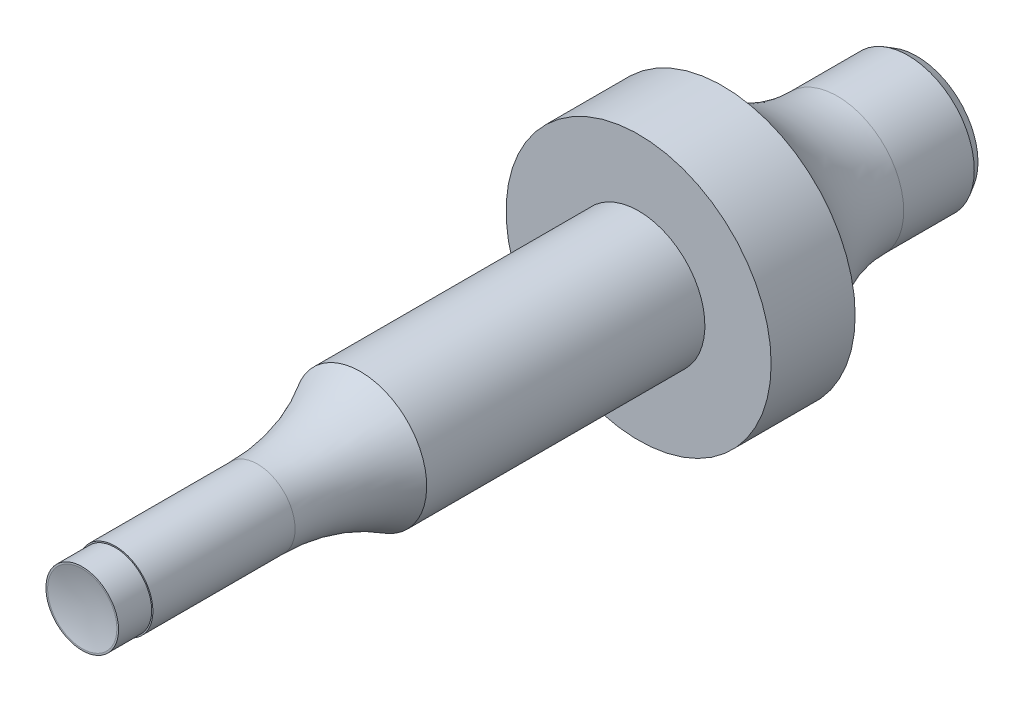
from build123d import *

# Parameters (mm, degrees)
SKETCH1_R           = 7.94
BOSS_EXTRUDE1_DEPTH = 100
SKETCH2_OUTSIDE_W   = 38.378
SKETCH2_OUTSIDE_H   = 38.378
SKETCH2_OUTSIDE_R   = 4.5
CUT_EXTRUDE1_DEPTH  = 33.333333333
SKETCH3_OUTSIDE_W   = 38.378
SKETCH3_OUTSIDE_H   = 38.378
SKETCH3_OUTSIDE_R   = 4.35
CUT_EXTRUDE2_DEPTH  = 3.97
CHAMFER1_SIZE       = 1.058666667
CHAMFER1_SIZE2      = 0.611221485


with BuildPart() as part:
    # Sketch1 → Boss-Extrude1 (new body)
    with BuildSketch(Plane.XY):
        Circle(SKETCH1_R)
    extrude(amount=-BOSS_EXTRUDE1_DEPTH)

    # Sketch2 outside → Cut-Extrude1 (cut)
    with BuildSketch(Plane.XY):
        Rectangle(SKETCH2_OUTSIDE_W, SKETCH2_OUTSIDE_H)
        Circle(SKETCH2_OUTSIDE_R, mode=Mode.SUBTRACT)
    extrude(amount=-CUT_EXTRUDE1_DEPTH, mode=Mode.SUBTRACT)

    # Sketch3 outside → Cut-Extrude2 (cut)
    with BuildSketch(Plane.XY):
        Rectangle(SKETCH3_OUTSIDE_W, SKETCH3_OUTSIDE_H)
        Circle(SKETCH3_OUTSIDE_R, mode=Mode.SUBTRACT)
    extrude(amount=-CUT_EXTRUDE2_DEPTH, mode=Mode.SUBTRACT)

    # Sketch4 → Cut-Revolve1 (revolve, cut)
    with BuildSketch(Plane(origin=(0, 0, 0), x_dir=(0, 0, -1), z_dir=(1, 0, 0))):
        with BuildLine():
            Line((0, 0), (0, 4.15))
            ThreePointArc((0, 4.15), (0.413289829, 2.093265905), (0.551859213, 0))
            Line((0.551859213, 0), (0, 0))
        make_face()
    revolve(axis=Axis((0, 0, 0), (0, 0, -1)), mode=Mode.SUBTRACT)

    # Chamfer1
    chamfer1_edges = [part.edges().sort_by_distance(p)[0] for p in [
        (-7.94, 0, -100),
    ]]
    chamfer1_side = [part.faces().sort_by_distance(p)[0] for p in [
        (-7.94, 0, -66.666666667),
    ]]
    chamfer(chamfer1_edges, length=CHAMFER1_SIZE, length2=CHAMFER1_SIZE2, reference=chamfer1_side[0])

    # Sketch5 → Revolve1 (revolve)
    with BuildSketch(Plane(origin=(0, 0, 0), x_dir=(0, 0, -1), z_dir=(1, 0, 0)), mode=Mode.PRIVATE) as revolve1_sk:
        with BuildLine():
            Line((33.333333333, 0), (21.002558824, 0))
            Line((21.002558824, 0), (21.002558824, 4.5))
            ThreePointArc((21.002558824, 4.5), (27.403371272, 5.376111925), (33.333333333, 7.94))
            Line((33.333333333, 7.94), (33.333333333, 0))
        make_face()
    revolve(revolve1_sk.sketch.rotate(Axis((0, 0, -33.333333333), (0, 0, 1)), 270), axis=Axis((0, 0, -33.333333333), (0, 0, 1)))

    # Sketch6 → Revolve2 (revolve)
    with BuildSketch(Plane(origin=(0, 0, 0), x_dir=(0, 0, -1), z_dir=(1, 0, 0)), mode=Mode.PRIVATE) as revolve2_sk:
        with BuildLine():
            Line((66.666666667, 0), (90.486666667, 0))
            Line((90.486666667, 0), (90.486666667, 7.94))
            ThreePointArc((90.486666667, 7.94), (82.546666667, 10.067516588), (76.734183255, 15.88))
            Line((76.734183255, 15.88), (66.666666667, 15.88))
            Line((66.666666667, 15.88), (66.666666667, 0))
        make_face()
    revolve(revolve2_sk.sketch.rotate(Axis((0, 0, -66.666666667), (0, 0, -1)), 90), axis=Axis((0, 0, -66.666666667), (0, 0, -1)))


solid = part.part
